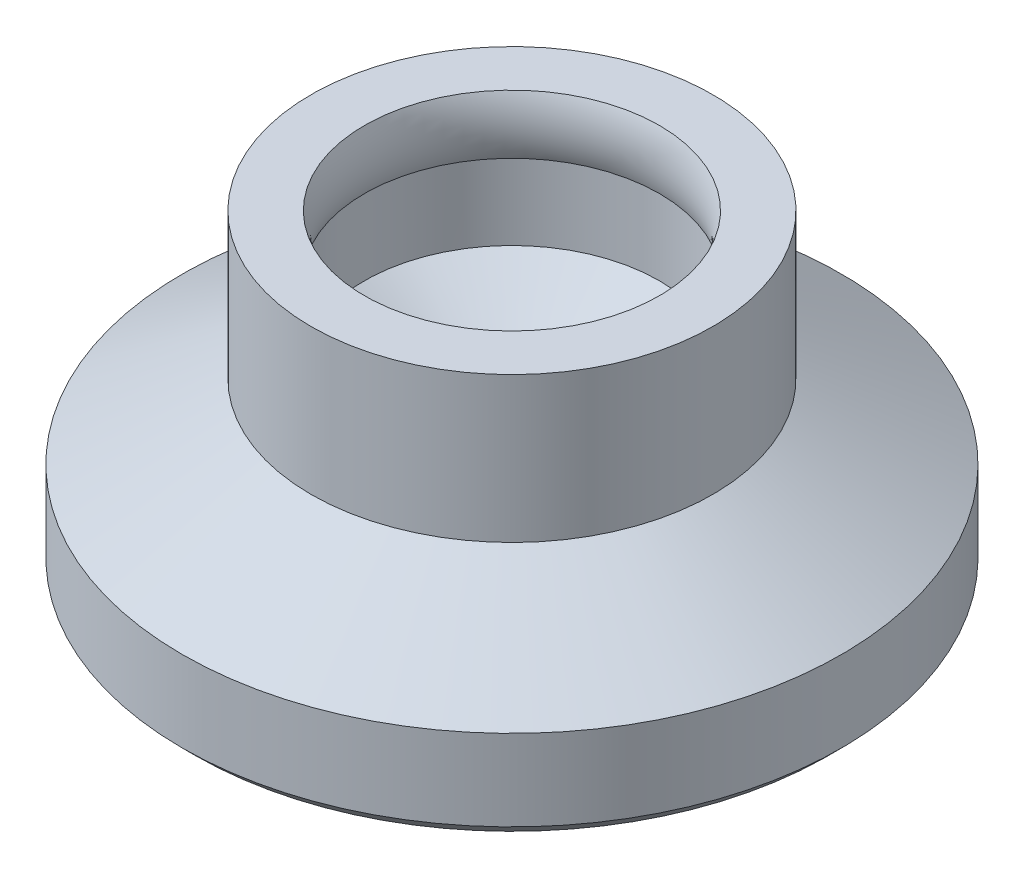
ISO-10303-21;
HEADER;
FILE_DESCRIPTION(('STEP AP214'),'2;1');
FILE_NAME('part.step','',(''),(''),'','','');
FILE_SCHEMA(('AUTOMOTIVE_DESIGN { 1 0 10303 214 1 1 1 1 }'));
ENDSEC;
DATA;
#1=APPLICATION_CONTEXT('core data for automotive mechanical design processes');
#2=APPLICATION_PROTOCOL_DEFINITION('international standard','automotive_design',2000,#1);
#3=PRODUCT_CONTEXT('',#1,'mechanical');
#4=PRODUCT('Part','Part','',(#3));
#5=PRODUCT_RELATED_PRODUCT_CATEGORY('part','',(#4));
#6=PRODUCT_DEFINITION_FORMATION('','',#4);
#7=PRODUCT_DEFINITION_CONTEXT('part definition',#1,'design');
#8=PRODUCT_DEFINITION('design','',#6,#7);
#9=PRODUCT_DEFINITION_SHAPE('','',#8);
#10=(LENGTH_UNIT() NAMED_UNIT(*) SI_UNIT(.MILLI.,.METRE.));
#11=(NAMED_UNIT(*) PLANE_ANGLE_UNIT() SI_UNIT($,.RADIAN.));
#12=(NAMED_UNIT(*) SI_UNIT($,.STERADIAN.) SOLID_ANGLE_UNIT());
#13=UNCERTAINTY_MEASURE_WITH_UNIT(LENGTH_MEASURE(1.E-05),#10,'distance_accuracy_value','');
#14=(GEOMETRIC_REPRESENTATION_CONTEXT(3) GLOBAL_UNCERTAINTY_ASSIGNED_CONTEXT((#13)) GLOBAL_UNIT_ASSIGNED_CONTEXT((#10,
#11,#12)) REPRESENTATION_CONTEXT('',''));
#15=CARTESIAN_POINT('',(0.,0.,0.));
#16=DIRECTION('',(0.,0.,1.));
#17=DIRECTION('',(1.,0.,0.));
#18=AXIS2_PLACEMENT_3D('',#15,#16,#17);
#19=CARTESIAN_POINT('',(0.,5.,0.));
#20=DIRECTION('',(0.,-1.,0.));
#21=DIRECTION('',(0.,0.,-1.));
#22=AXIS2_PLACEMENT_3D('',#19,#20,#21);
#23=CYLINDRICAL_SURFACE('',#22,6.4);
#24=CARTESIAN_POINT('',(0.,0.367136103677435,0.));
#25=DIRECTION('',(0.,1.,0.));
#26=DIRECTION('',(0.,0.,1.));
#27=AXIS2_PLACEMENT_3D('',#24,#25,#26);
#28=CIRCLE('',#27,6.4);
#29=CARTESIAN_POINT('',(0.,0.367136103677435,6.4));
#30=VERTEX_POINT('',#29);
#31=EDGE_CURVE('E91',#30,#30,#28,.T.);
#32=ORIENTED_EDGE('',*,*,#31,.T.);
#33=EDGE_LOOP('',(#32));
#34=FACE_BOUND('',#33,.T.);
#35=CARTESIAN_POINT('',(0.,5.,0.));
#36=DIRECTION('',(0.,1.,0.));
#37=DIRECTION('',(0.,0.,1.));
#38=AXIS2_PLACEMENT_3D('',#35,#36,#37);
#39=CIRCLE('',#38,6.4);
#40=CARTESIAN_POINT('',(0.,5.,6.4));
#41=VERTEX_POINT('',#40);
#42=EDGE_CURVE('E93',#41,#41,#39,.T.);
#43=ORIENTED_EDGE('',*,*,#42,.F.);
#44=EDGE_LOOP('',(#43));
#45=FACE_BOUND('',#44,.T.);
#46=ADVANCED_FACE('F37',(#34,#45),#23,.T.);
#47=CARTESIAN_POINT('',(0.,5.,0.));
#48=DIRECTION('',(0.,1.,0.));
#49=DIRECTION('',(0.,0.,1.));
#50=AXIS2_PLACEMENT_3D('',#47,#48,#49);
#51=PLANE('',#50);
#52=CARTESIAN_POINT('',(0.,5.,0.));
#53=DIRECTION('',(0.,-1.,0.));
#54=DIRECTION('',(0.,0.,-1.));
#55=AXIS2_PLACEMENT_3D('',#52,#53,#54);
#56=CIRCLE('',#55,4.7);
#57=CARTESIAN_POINT('',(0.,5.,-4.7));
#58=VERTEX_POINT('',#57);
#59=EDGE_CURVE('E112',#58,#58,#56,.T.);
#60=ORIENTED_EDGE('',*,*,#59,.T.);
#61=EDGE_LOOP('',(#60));
#62=FACE_BOUND('',#61,.T.);
#63=ORIENTED_EDGE('',*,*,#42,.T.);
#64=EDGE_LOOP('',(#63));
#65=FACE_BOUND('',#64,.T.);
#66=ADVANCED_FACE('F65',(#62,#65),#51,.T.);
#67=CARTESIAN_POINT('',(0.,0.367136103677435,0.));
#68=DIRECTION('',(0.,-1.,0.));
#69=DIRECTION('',(0.,0.,-1.));
#70=AXIS2_PLACEMENT_3D('',#67,#68,#69);
#71=CONICAL_SURFACE('',#70,6.4,1.0471975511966);
#72=CARTESIAN_POINT('',(0.,-2.,0.));
#73=DIRECTION('',(0.,1.,0.));
#74=DIRECTION('',(0.,0.,1.));
#75=AXIS2_PLACEMENT_3D('',#72,#73,#74);
#76=CIRCLE('',#75,10.5);
#77=CARTESIAN_POINT('',(0.,-2.,10.5));
#78=VERTEX_POINT('',#77);
#79=EDGE_CURVE('E89',#78,#78,#76,.T.);
#80=ORIENTED_EDGE('',*,*,#79,.T.);
#81=EDGE_LOOP('',(#80));
#82=FACE_BOUND('',#81,.T.);
#83=ORIENTED_EDGE('',*,*,#31,.F.);
#84=EDGE_LOOP('',(#83));
#85=FACE_BOUND('',#84,.T.);
#86=ADVANCED_FACE('F70',(#82,#85),#71,.T.);
#87=CARTESIAN_POINT('',(0.,-5.,0.));
#88=DIRECTION('',(0.,1.,0.));
#89=DIRECTION('',(0.,0.,1.));
#90=AXIS2_PLACEMENT_3D('',#87,#88,#89);
#91=PLANE('',#90);
#92=CARTESIAN_POINT('',(0.,-5.,0.));
#93=DIRECTION('',(0.,1.,0.));
#94=DIRECTION('',(0.,0.,1.));
#95=AXIS2_PLACEMENT_3D('',#92,#93,#94);
#96=CIRCLE('',#95,10.08);
#97=CARTESIAN_POINT('',(0.,-5.,10.08));
#98=VERTEX_POINT('',#97);
#99=EDGE_CURVE('E45',#98,#98,#96,.F.);
#100=ORIENTED_EDGE('',*,*,#99,.T.);
#101=EDGE_LOOP('',(#100));
#102=FACE_BOUND('',#101,.T.);
#103=ADVANCED_FACE('F76',(#102),#91,.F.);
#104=CARTESIAN_POINT('',(0.,-2.,0.));
#105=DIRECTION('',(0.,-1.,0.));
#106=DIRECTION('',(0.,0.,-1.));
#107=AXIS2_PLACEMENT_3D('',#104,#105,#106);
#108=CYLINDRICAL_SURFACE('',#107,10.5);
#109=CARTESIAN_POINT('',(0.,-4.57999999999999,0.));
#110=DIRECTION('',(0.,1.,0.));
#111=DIRECTION('',(0.,0.,1.));
#112=AXIS2_PLACEMENT_3D('',#109,#110,#111);
#113=CIRCLE('',#112,10.5);
#114=CARTESIAN_POINT('',(0.,-4.57999999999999,10.5));
#115=VERTEX_POINT('',#114);
#116=EDGE_CURVE('E11',#115,#115,#113,.T.);
#117=ORIENTED_EDGE('',*,*,#116,.T.);
#118=EDGE_LOOP('',(#117));
#119=FACE_BOUND('',#118,.T.);
#120=ORIENTED_EDGE('',*,*,#79,.F.);
#121=EDGE_LOOP('',(#120));
#122=FACE_BOUND('',#121,.T.);
#123=ADVANCED_FACE('F60',(#119,#122),#108,.T.);
#124=CARTESIAN_POINT('',(0.,-5.,0.));
#125=DIRECTION('',(0.,1.,0.));
#126=DIRECTION('',(0.,0.,1.));
#127=AXIS2_PLACEMENT_3D('',#124,#125,#126);
#128=CONICAL_SURFACE('',#127,10.08,0.785398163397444);
#129=CARTESIAN_POINT('',(0.,-4.57999999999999,10.5));
#130=CARTESIAN_POINT('',(0.,-4.58437499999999,10.495625));
#131=CARTESIAN_POINT('',(0.,-4.58874999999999,10.49125));
#132=CARTESIAN_POINT('',(0.,-4.59749999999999,10.4825));
#133=CARTESIAN_POINT('',(0.,-4.60187499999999,10.478125));
#134=CARTESIAN_POINT('',(0.,-4.61062499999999,10.469375));
#135=CARTESIAN_POINT('',(0.,-4.61499999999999,10.465));
#136=CARTESIAN_POINT('',(0.,-4.62374999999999,10.45625));
#137=CARTESIAN_POINT('',(0.,-4.62812499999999,10.451875));
#138=CARTESIAN_POINT('',(0.,-4.63687499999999,10.443125));
#139=CARTESIAN_POINT('',(0.,-4.64124999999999,10.43875));
#140=CARTESIAN_POINT('',(0.,-4.64999999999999,10.43));
#141=CARTESIAN_POINT('',(0.,-4.65437499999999,10.425625));
#142=CARTESIAN_POINT('',(0.,-4.66312499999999,10.416875));
#143=CARTESIAN_POINT('',(0.,-4.66749999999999,10.4125));
#144=CARTESIAN_POINT('',(0.,-4.67624999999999,10.40375));
#145=CARTESIAN_POINT('',(0.,-4.68062499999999,10.399375));
#146=CARTESIAN_POINT('',(0.,-4.68937499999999,10.390625));
#147=CARTESIAN_POINT('',(0.,-4.69374999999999,10.38625));
#148=CARTESIAN_POINT('',(0.,-4.70249999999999,10.3775));
#149=CARTESIAN_POINT('',(0.,-4.70687499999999,10.373125));
#150=CARTESIAN_POINT('',(0.,-4.71562499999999,10.364375));
#151=CARTESIAN_POINT('',(0.,-4.72,10.36));
#152=CARTESIAN_POINT('',(0.,-4.72875,10.35125));
#153=CARTESIAN_POINT('',(0.,-4.73312499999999,10.346875));
#154=CARTESIAN_POINT('',(0.,-4.74187499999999,10.338125));
#155=CARTESIAN_POINT('',(0.,-4.74625,10.33375));
#156=CARTESIAN_POINT('',(0.,-4.755,10.325));
#157=CARTESIAN_POINT('',(0.,-4.759375,10.320625));
#158=CARTESIAN_POINT('',(0.,-4.768125,10.311875));
#159=CARTESIAN_POINT('',(0.,-4.7725,10.3075));
#160=CARTESIAN_POINT('',(0.,-4.78125,10.29875));
#161=CARTESIAN_POINT('',(0.,-4.785625,10.294375));
#162=CARTESIAN_POINT('',(0.,-4.794375,10.285625));
#163=CARTESIAN_POINT('',(0.,-4.79875,10.28125));
#164=CARTESIAN_POINT('',(0.,-4.8075,10.2725));
#165=CARTESIAN_POINT('',(0.,-4.811875,10.268125));
#166=CARTESIAN_POINT('',(0.,-4.820625,10.259375));
#167=CARTESIAN_POINT('',(0.,-4.825,10.255));
#168=CARTESIAN_POINT('',(0.,-4.83375,10.24625));
#169=CARTESIAN_POINT('',(0.,-4.838125,10.241875));
#170=CARTESIAN_POINT('',(0.,-4.846875,10.233125));
#171=CARTESIAN_POINT('',(0.,-4.85125,10.22875));
#172=CARTESIAN_POINT('',(0.,-4.86,10.22));
#173=CARTESIAN_POINT('',(0.,-4.864375,10.215625));
#174=CARTESIAN_POINT('',(0.,-4.873125,10.206875));
#175=CARTESIAN_POINT('',(0.,-4.8775,10.2025));
#176=CARTESIAN_POINT('',(0.,-4.88625,10.19375));
#177=CARTESIAN_POINT('',(0.,-4.890625,10.189375));
#178=CARTESIAN_POINT('',(0.,-4.899375,10.180625));
#179=CARTESIAN_POINT('',(0.,-4.90375,10.17625));
#180=CARTESIAN_POINT('',(0.,-4.9125,10.1675));
#181=CARTESIAN_POINT('',(0.,-4.916875,10.163125));
#182=CARTESIAN_POINT('',(0.,-4.925625,10.154375));
#183=CARTESIAN_POINT('',(0.,-4.93,10.15));
#184=CARTESIAN_POINT('',(0.,-4.93875,10.14125));
#185=CARTESIAN_POINT('',(0.,-4.943125,10.136875));
#186=CARTESIAN_POINT('',(0.,-4.951875,10.128125));
#187=CARTESIAN_POINT('',(0.,-4.95625,10.12375));
#188=CARTESIAN_POINT('',(0.,-4.965,10.115));
#189=CARTESIAN_POINT('',(0.,-4.969375,10.110625));
#190=CARTESIAN_POINT('',(0.,-4.978125,10.101875));
#191=CARTESIAN_POINT('',(0.,-4.9825,10.0975));
#192=CARTESIAN_POINT('',(0.,-4.99125,10.08875));
#193=CARTESIAN_POINT('',(0.,-4.995625,10.084375));
#194=CARTESIAN_POINT('',(0.,-5.,10.08));
#195=B_SPLINE_CURVE_WITH_KNOTS('',3,(#129,#130,#131,#132,#133,#134,#135,#136,#137,#138,#139,
#140,#141,#142,#143,#144,#145,#146,#147,#148,#149,#150,#151,#152,#153,#154,#155,#156,#157,#158,
#159,#160,#161,#162,#163,#164,#165,#166,#167,#168,#169,#170,#171,#172,#173,#174,#175,#176,#177,
#178,#179,#180,#181,#182,#183,#184,#185,#186,#187,#188,#189,#190,#191,#192,#193,#194),
.UNSPECIFIED.,.F.,.F.,(4,2,2,2,2,2,2,2,2,2,2,2,2,2,2,2,2,2,2,2,2,2,2,2,2,2,2,2,2,2,2,2,4),(0.,
0.0185615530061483,0.0371231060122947,0.0556846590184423,0.0742462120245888,0.0928077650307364,
0.111369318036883,0.129930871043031,0.148492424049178,0.167053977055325,0.185615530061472,
0.20417708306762,0.222738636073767,0.241300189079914,0.259861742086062,0.278423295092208,
0.296984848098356,0.315546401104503,0.33410795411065,0.352669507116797,0.371231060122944,
0.389792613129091,0.408354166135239,0.426915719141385,0.445477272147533,0.464038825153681,
0.482600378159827,0.501161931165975,0.519723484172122,0.53828503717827,0.556846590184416,
0.575408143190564,0.59396969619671),.UNSPECIFIED.);
#196=EDGE_CURVE('BSEAM39',#115,#98,#195,.T.);
#197=ORIENTED_EDGE('',*,*,#116,.F.);
#198=ORIENTED_EDGE('',*,*,#99,.F.);
#199=ORIENTED_EDGE('',*,*,#196,.T.);
#200=ORIENTED_EDGE('',*,*,#196,.F.);
#201=EDGE_LOOP('',(#197,#199,#198,#200));
#202=FACE_BOUND('',#201,.T.);
#203=ADVANCED_FACE('F39',(#202),#128,.T.);
#204=CARTESIAN_POINT('',(0.,-2.,0.));
#205=DIRECTION('',(0.,1.,0.));
#206=DIRECTION('',(0.,0.,1.));
#207=AXIS2_PLACEMENT_3D('',#204,#205,#206);
#208=CONICAL_SURFACE('',#207,0.,1.04719755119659);
#209=CARTESIAN_POINT('',(0.,0.713546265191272,0.));
#210=DIRECTION('',(0.,-1.,0.));
#211=DIRECTION('',(0.,0.,-1.));
#212=AXIS2_PLACEMENT_3D('',#209,#210,#211);
#213=CIRCLE('',#212,4.7);
#214=CARTESIAN_POINT('',(0.,0.713546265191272,-4.7));
#215=VERTEX_POINT('',#214);
#216=EDGE_CURVE('E100',#215,#215,#213,.T.);
#217=ORIENTED_EDGE('',*,*,#216,.F.);
#218=EDGE_LOOP('',(#217));
#219=FACE_BOUND('',#218,.T.);
#220=CARTESIAN_POINT('',(0.,-2.,0.));
#221=VERTEX_POINT('',#220);
#222=VERTEX_LOOP('',#221);
#223=FACE_BOUND('',#222,.T.);
#224=ADVANCED_FACE('F48',(#219,#223),#208,.F.);
#225=CARTESIAN_POINT('',(0.,0.,0.));
#226=DIRECTION('',(0.,-1.,0.));
#227=DIRECTION('',(0.,0.,-1.));
#228=AXIS2_PLACEMENT_3D('',#225,#226,#227);
#229=CYLINDRICAL_SURFACE('',#228,4.7);
#230=CARTESIAN_POINT('',(0.,3.12,0.));
#231=DIRECTION('',(0.,-1.,0.));
#232=DIRECTION('',(0.,0.,-1.));
#233=AXIS2_PLACEMENT_3D('',#230,#231,#232);
#234=CIRCLE('',#233,4.7);
#235=CARTESIAN_POINT('',(0.,3.12,-4.7));
#236=VERTEX_POINT('',#235);
#237=EDGE_CURVE('E108',#236,#236,#234,.T.);
#238=ORIENTED_EDGE('',*,*,#237,.F.);
#239=EDGE_LOOP('',(#238));
#240=FACE_BOUND('',#239,.T.);
#241=ORIENTED_EDGE('',*,*,#216,.T.);
#242=EDGE_LOOP('',(#241));
#243=FACE_BOUND('',#242,.T.);
#244=ADVANCED_FACE('F50',(#240,#243),#229,.F.);
#245=CARTESIAN_POINT('',(0.,4.06,0.));
#246=DIRECTION('',(0.,-1.,0.));
#247=DIRECTION('',(0.,0.,-1.));
#248=AXIS2_PLACEMENT_3D('',#245,#246,#247);
#249=TOROIDAL_SURFACE('',#248,6.95599999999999,2.44399999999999);
#250=ORIENTED_EDGE('',*,*,#59,.F.);
#251=EDGE_LOOP('',(#250));
#252=FACE_BOUND('',#251,.T.);
#253=ORIENTED_EDGE('',*,*,#237,.T.);
#254=EDGE_LOOP('',(#253));
#255=FACE_BOUND('',#254,.T.);
#256=ADVANCED_FACE('F57',(#252,#255),#249,.T.);
#257=CLOSED_SHELL('',(#46,#66,#86,#103,#123,#203,#224,#244,#256));
#258=MANIFOLD_SOLID_BREP('B2',#257);
#259=ADVANCED_BREP_SHAPE_REPRESENTATION('',(#18,#258),#14);
#260=SHAPE_DEFINITION_REPRESENTATION(#9,#259);
ENDSEC;
END-ISO-10303-21;
